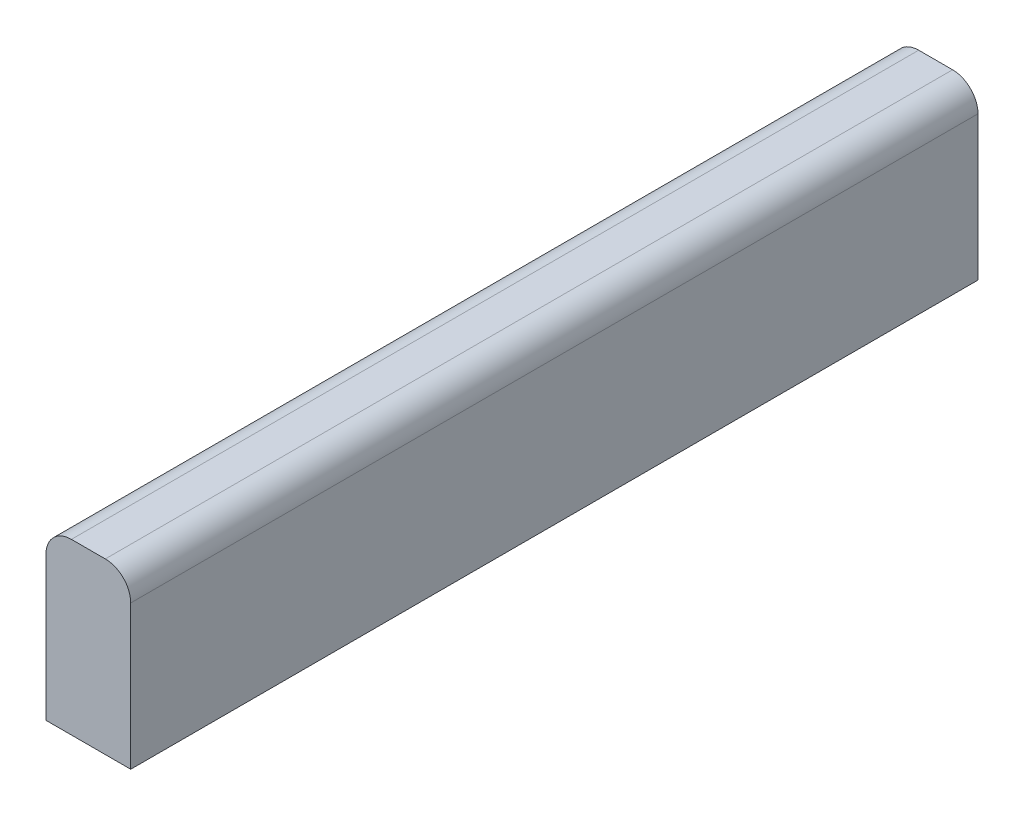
ISO-10303-21;
HEADER;
FILE_DESCRIPTION(('STEP AP214'),'2;1');
FILE_NAME('part.step','',(''),(''),'','','');
FILE_SCHEMA(('AUTOMOTIVE_DESIGN { 1 0 10303 214 1 1 1 1 }'));
ENDSEC;
DATA;
#1=APPLICATION_CONTEXT('core data for automotive mechanical design processes');
#2=APPLICATION_PROTOCOL_DEFINITION('international standard','automotive_design',2000,#1);
#3=PRODUCT_CONTEXT('',#1,'mechanical');
#4=PRODUCT('Part','Part','',(#3));
#5=PRODUCT_RELATED_PRODUCT_CATEGORY('part','',(#4));
#6=PRODUCT_DEFINITION_FORMATION('','',#4);
#7=PRODUCT_DEFINITION_CONTEXT('part definition',#1,'design');
#8=PRODUCT_DEFINITION('design','',#6,#7);
#9=PRODUCT_DEFINITION_SHAPE('','',#8);
#10=(LENGTH_UNIT() NAMED_UNIT(*) SI_UNIT(.MILLI.,.METRE.));
#11=(NAMED_UNIT(*) PLANE_ANGLE_UNIT() SI_UNIT($,.RADIAN.));
#12=(NAMED_UNIT(*) SI_UNIT($,.STERADIAN.) SOLID_ANGLE_UNIT());
#13=UNCERTAINTY_MEASURE_WITH_UNIT(LENGTH_MEASURE(1.E-05),#10,'distance_accuracy_value','');
#14=(GEOMETRIC_REPRESENTATION_CONTEXT(3) GLOBAL_UNCERTAINTY_ASSIGNED_CONTEXT((#13)) GLOBAL_UNIT_ASSIGNED_CONTEXT((#10,
#11,#12)) REPRESENTATION_CONTEXT('',''));
#15=CARTESIAN_POINT('',(0.,0.,0.));
#16=DIRECTION('',(0.,0.,1.));
#17=DIRECTION('',(1.,0.,0.));
#18=AXIS2_PLACEMENT_3D('',#15,#16,#17);
#19=CARTESIAN_POINT('',(0.,0.,100.));
#20=DIRECTION('',(1.,0.,0.));
#21=DIRECTION('',(0.,0.,-1.));
#22=AXIS2_PLACEMENT_3D('',#19,#20,#21);
#23=PLANE('',#22);
#24=DIRECTION('',(0.,-1.,0.));
#25=VECTOR('',#24,1.);
#26=CARTESIAN_POINT('',(0.,0.,0.));
#27=LINE('',#26,#25);
#28=CARTESIAN_POINT('',(0.,17.,0.));
#29=VERTEX_POINT('',#28);
#30=CARTESIAN_POINT('',(0.,0.,0.));
#31=VERTEX_POINT('',#30);
#32=EDGE_CURVE('E117',#29,#31,#27,.T.);
#33=ORIENTED_EDGE('',*,*,#32,.T.);
#34=DIRECTION('',(0.,0.,-1.));
#35=VECTOR('',#34,1.);
#36=CARTESIAN_POINT('',(0.,0.,100.));
#37=LINE('',#36,#35);
#38=CARTESIAN_POINT('',(0.,0.,100.));
#39=VERTEX_POINT('',#38);
#40=EDGE_CURVE('E11',#39,#31,#37,.T.);
#41=ORIENTED_EDGE('',*,*,#40,.F.);
#42=DIRECTION('',(0.,-1.,0.));
#43=VECTOR('',#42,1.);
#44=CARTESIAN_POINT('',(0.,0.,100.));
#45=LINE('',#44,#43);
#46=CARTESIAN_POINT('',(0.,17.,100.));
#47=VERTEX_POINT('',#46);
#48=EDGE_CURVE('E127',#47,#39,#45,.T.);
#49=ORIENTED_EDGE('',*,*,#48,.F.);
#50=DIRECTION('',(0.,0.,-1.));
#51=VECTOR('',#50,1.);
#52=CARTESIAN_POINT('',(0.,17.,100.));
#53=LINE('',#52,#51);
#54=EDGE_CURVE('E113',#47,#29,#53,.T.);
#55=ORIENTED_EDGE('',*,*,#54,.T.);
#56=EDGE_LOOP('',(#33,#41,#49,#55));
#57=FACE_BOUND('',#56,.T.);
#58=ADVANCED_FACE('F33',(#57),#23,.F.);
#59=CARTESIAN_POINT('',(0.,0.,100.));
#60=DIRECTION('',(0.,1.,0.));
#61=DIRECTION('',(0.,0.,1.));
#62=AXIS2_PLACEMENT_3D('',#59,#60,#61);
#63=PLANE('',#62);
#64=DIRECTION('',(1.,0.,0.));
#65=VECTOR('',#64,1.);
#66=CARTESIAN_POINT('',(0.,0.,0.));
#67=LINE('',#66,#65);
#68=CARTESIAN_POINT('',(10.,0.,0.));
#69=VERTEX_POINT('',#68);
#70=EDGE_CURVE('E120',#31,#69,#67,.T.);
#71=ORIENTED_EDGE('',*,*,#70,.T.);
#72=DIRECTION('',(0.,0.,-1.));
#73=VECTOR('',#72,1.);
#74=CARTESIAN_POINT('',(10.,0.,100.));
#75=LINE('',#74,#73);
#76=CARTESIAN_POINT('',(10.,0.,100.));
#77=VERTEX_POINT('',#76);
#78=EDGE_CURVE('E41',#77,#69,#75,.T.);
#79=ORIENTED_EDGE('',*,*,#78,.F.);
#80=DIRECTION('',(1.,0.,0.));
#81=VECTOR('',#80,1.);
#82=CARTESIAN_POINT('',(0.,0.,100.));
#83=LINE('',#82,#81);
#84=EDGE_CURVE('E86',#39,#77,#83,.T.);
#85=ORIENTED_EDGE('',*,*,#84,.F.);
#86=ORIENTED_EDGE('',*,*,#40,.T.);
#87=EDGE_LOOP('',(#71,#79,#85,#86));
#88=FACE_BOUND('',#87,.T.);
#89=ADVANCED_FACE('F151',(#88),#63,.F.);
#90=CARTESIAN_POINT('',(10.,0.,100.));
#91=DIRECTION('',(-1.,0.,0.));
#92=DIRECTION('',(0.,0.,1.));
#93=AXIS2_PLACEMENT_3D('',#90,#91,#92);
#94=PLANE('',#93);
#95=DIRECTION('',(0.,1.,0.));
#96=VECTOR('',#95,1.);
#97=CARTESIAN_POINT('',(10.,0.,0.));
#98=LINE('',#97,#96);
#99=CARTESIAN_POINT('',(10.,17.,0.));
#100=VERTEX_POINT('',#99);
#101=EDGE_CURVE('E122',#69,#100,#98,.T.);
#102=ORIENTED_EDGE('',*,*,#101,.T.);
#103=DIRECTION('',(0.,0.,-1.));
#104=VECTOR('',#103,1.);
#105=CARTESIAN_POINT('',(10.,17.,100.));
#106=LINE('',#105,#104);
#107=CARTESIAN_POINT('',(10.,17.,100.));
#108=VERTEX_POINT('',#107);
#109=EDGE_CURVE('E108',#108,#100,#106,.T.);
#110=ORIENTED_EDGE('',*,*,#109,.F.);
#111=DIRECTION('',(0.,1.,0.));
#112=VECTOR('',#111,1.);
#113=CARTESIAN_POINT('',(10.,0.,100.));
#114=LINE('',#113,#112);
#115=EDGE_CURVE('E99',#77,#108,#114,.T.);
#116=ORIENTED_EDGE('',*,*,#115,.F.);
#117=ORIENTED_EDGE('',*,*,#78,.T.);
#118=EDGE_LOOP('',(#102,#110,#116,#117));
#119=FACE_BOUND('',#118,.T.);
#120=ADVANCED_FACE('F133',(#119),#94,.F.);
#121=CARTESIAN_POINT('',(7.,17.,100.));
#122=DIRECTION('',(0.,0.,-1.));
#123=DIRECTION('',(-1.,0.,0.));
#124=AXIS2_PLACEMENT_3D('',#121,#122,#123);
#125=CYLINDRICAL_SURFACE('',#124,3.);
#126=CARTESIAN_POINT('',(7.,17.,0.));
#127=DIRECTION('',(0.,0.,1.));
#128=DIRECTION('',(1.,0.,0.));
#129=AXIS2_PLACEMENT_3D('',#126,#127,#128);
#130=CIRCLE('',#129,3.);
#131=CARTESIAN_POINT('',(6.99999999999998,20.,0.));
#132=VERTEX_POINT('',#131);
#133=EDGE_CURVE('E107',#100,#132,#130,.T.);
#134=ORIENTED_EDGE('',*,*,#133,.T.);
#135=DIRECTION('',(0.,0.,-1.));
#136=VECTOR('',#135,1.);
#137=CARTESIAN_POINT('',(6.99999999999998,20.,100.));
#138=LINE('',#137,#136);
#139=CARTESIAN_POINT('',(6.99999999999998,20.,100.));
#140=VERTEX_POINT('',#139);
#141=EDGE_CURVE('E104',#140,#132,#138,.T.);
#142=ORIENTED_EDGE('',*,*,#141,.F.);
#143=CARTESIAN_POINT('',(7.,17.,100.));
#144=DIRECTION('',(0.,0.,1.));
#145=DIRECTION('',(1.,0.,0.));
#146=AXIS2_PLACEMENT_3D('',#143,#144,#145);
#147=CIRCLE('',#146,3.);
#148=EDGE_CURVE('E93',#108,#140,#147,.T.);
#149=ORIENTED_EDGE('',*,*,#148,.F.);
#150=ORIENTED_EDGE('',*,*,#109,.T.);
#151=EDGE_LOOP('',(#134,#142,#149,#150));
#152=FACE_BOUND('',#151,.T.);
#153=ADVANCED_FACE('F105',(#152),#125,.T.);
#154=CARTESIAN_POINT('',(3.00000000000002,20.,100.));
#155=DIRECTION('',(0.,-1.,0.));
#156=DIRECTION('',(0.,0.,-1.));
#157=AXIS2_PLACEMENT_3D('',#154,#155,#156);
#158=PLANE('',#157);
#159=DIRECTION('',(-1.,0.,0.));
#160=VECTOR('',#159,1.);
#161=CARTESIAN_POINT('',(3.00000000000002,20.,0.));
#162=LINE('',#161,#160);
#163=CARTESIAN_POINT('',(3.00000000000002,20.,0.));
#164=VERTEX_POINT('',#163);
#165=EDGE_CURVE('E72',#132,#164,#162,.T.);
#166=ORIENTED_EDGE('',*,*,#165,.T.);
#167=DIRECTION('',(0.,0.,-1.));
#168=VECTOR('',#167,1.);
#169=CARTESIAN_POINT('',(3.00000000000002,20.,100.));
#170=LINE('',#169,#168);
#171=CARTESIAN_POINT('',(3.00000000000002,20.,100.));
#172=VERTEX_POINT('',#171);
#173=EDGE_CURVE('E109',#172,#164,#170,.T.);
#174=ORIENTED_EDGE('',*,*,#173,.F.);
#175=DIRECTION('',(-1.,0.,0.));
#176=VECTOR('',#175,1.);
#177=CARTESIAN_POINT('',(3.00000000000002,20.,100.));
#178=LINE('',#177,#176);
#179=EDGE_CURVE('E97',#140,#172,#178,.T.);
#180=ORIENTED_EDGE('',*,*,#179,.F.);
#181=ORIENTED_EDGE('',*,*,#141,.T.);
#182=EDGE_LOOP('',(#166,#174,#180,#181));
#183=FACE_BOUND('',#182,.T.);
#184=ADVANCED_FACE('F111',(#183),#158,.F.);
#185=CARTESIAN_POINT('',(3.,17.,100.));
#186=DIRECTION('',(0.,0.,-1.));
#187=DIRECTION('',(-1.,0.,0.));
#188=AXIS2_PLACEMENT_3D('',#185,#186,#187);
#189=CYLINDRICAL_SURFACE('',#188,3.);
#190=CARTESIAN_POINT('',(3.,17.,0.));
#191=DIRECTION('',(0.,0.,1.));
#192=DIRECTION('',(-1.,0.,0.));
#193=AXIS2_PLACEMENT_3D('',#190,#191,#192);
#194=CIRCLE('',#193,3.);
#195=EDGE_CURVE('E78',#164,#29,#194,.T.);
#196=ORIENTED_EDGE('',*,*,#195,.T.);
#197=ORIENTED_EDGE('',*,*,#54,.F.);
#198=CARTESIAN_POINT('',(3.,17.,100.));
#199=DIRECTION('',(0.,0.,1.));
#200=DIRECTION('',(-1.,0.,0.));
#201=AXIS2_PLACEMENT_3D('',#198,#199,#200);
#202=CIRCLE('',#201,3.);
#203=EDGE_CURVE('E49',#172,#47,#202,.T.);
#204=ORIENTED_EDGE('',*,*,#203,.F.);
#205=ORIENTED_EDGE('',*,*,#173,.T.);
#206=EDGE_LOOP('',(#196,#197,#204,#205));
#207=FACE_BOUND('',#206,.T.);
#208=ADVANCED_FACE('F140',(#207),#189,.T.);
#209=CARTESIAN_POINT('',(3.,17.,100.));
#210=DIRECTION('',(0.,0.,-1.));
#211=DIRECTION('',(-1.,0.,0.));
#212=AXIS2_PLACEMENT_3D('',#209,#210,#211);
#213=PLANE('',#212);
#214=ORIENTED_EDGE('',*,*,#48,.T.);
#215=ORIENTED_EDGE('',*,*,#84,.T.);
#216=ORIENTED_EDGE('',*,*,#115,.T.);
#217=ORIENTED_EDGE('',*,*,#148,.T.);
#218=ORIENTED_EDGE('',*,*,#179,.T.);
#219=ORIENTED_EDGE('',*,*,#203,.T.);
#220=EDGE_LOOP('',(#214,#215,#216,#217,#218,#219));
#221=FACE_BOUND('',#220,.T.);
#222=ADVANCED_FACE('F95',(#221),#213,.F.);
#223=CARTESIAN_POINT('',(3.,17.,0.));
#224=DIRECTION('',(0.,0.,-1.));
#225=DIRECTION('',(-1.,0.,0.));
#226=AXIS2_PLACEMENT_3D('',#223,#224,#225);
#227=PLANE('',#226);
#228=ORIENTED_EDGE('',*,*,#32,.F.);
#229=ORIENTED_EDGE('',*,*,#195,.F.);
#230=ORIENTED_EDGE('',*,*,#165,.F.);
#231=ORIENTED_EDGE('',*,*,#133,.F.);
#232=ORIENTED_EDGE('',*,*,#101,.F.);
#233=ORIENTED_EDGE('',*,*,#70,.F.);
#234=EDGE_LOOP('',(#228,#229,#230,#231,#232,#233));
#235=FACE_BOUND('',#234,.T.);
#236=ADVANCED_FACE('F136',(#235),#227,.T.);
#237=CLOSED_SHELL('',(#58,#89,#120,#153,#184,#208,#222,#236));
#238=MANIFOLD_SOLID_BREP('B2',#237);
#239=ADVANCED_BREP_SHAPE_REPRESENTATION('',(#18,#238),#14);
#240=SHAPE_DEFINITION_REPRESENTATION(#9,#239);
ENDSEC;
END-ISO-10303-21;
